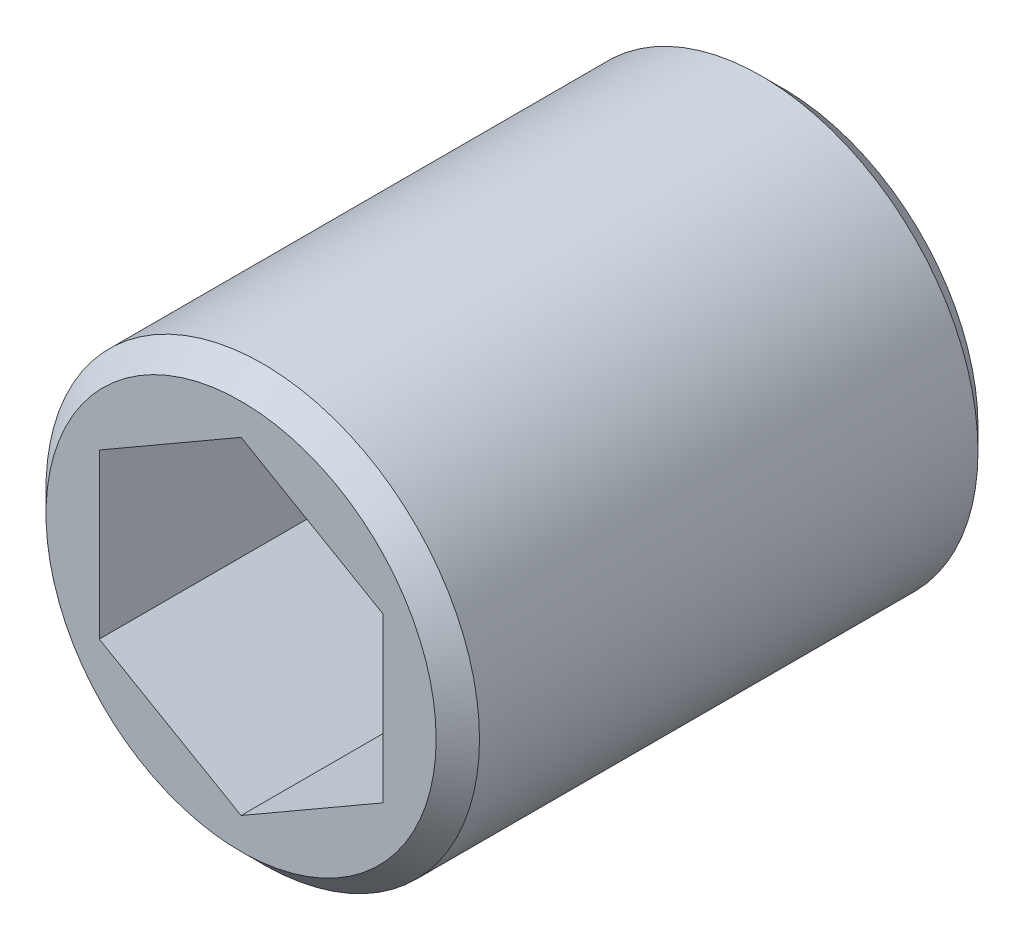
ISO-10303-21;
HEADER;
FILE_DESCRIPTION(('STEP AP214'),'2;1');
FILE_NAME('part.step','',(''),(''),'','','');
FILE_SCHEMA(('AUTOMOTIVE_DESIGN { 1 0 10303 214 1 1 1 1 }'));
ENDSEC;
DATA;
#1=APPLICATION_CONTEXT('core data for automotive mechanical design processes');
#2=APPLICATION_PROTOCOL_DEFINITION('international standard','automotive_design',2000,#1);
#3=PRODUCT_CONTEXT('',#1,'mechanical');
#4=PRODUCT('Part','Part','',(#3));
#5=PRODUCT_RELATED_PRODUCT_CATEGORY('part','',(#4));
#6=PRODUCT_DEFINITION_FORMATION('','',#4);
#7=PRODUCT_DEFINITION_CONTEXT('part definition',#1,'design');
#8=PRODUCT_DEFINITION('design','',#6,#7);
#9=PRODUCT_DEFINITION_SHAPE('','',#8);
#10=(LENGTH_UNIT() NAMED_UNIT(*) SI_UNIT(.MILLI.,.METRE.));
#11=(NAMED_UNIT(*) PLANE_ANGLE_UNIT() SI_UNIT($,.RADIAN.));
#12=(NAMED_UNIT(*) SI_UNIT($,.STERADIAN.) SOLID_ANGLE_UNIT());
#13=UNCERTAINTY_MEASURE_WITH_UNIT(LENGTH_MEASURE(1.E-05),#10,'distance_accuracy_value','');
#14=(GEOMETRIC_REPRESENTATION_CONTEXT(3) GLOBAL_UNCERTAINTY_ASSIGNED_CONTEXT((#13)) GLOBAL_UNIT_ASSIGNED_CONTEXT((#10,
#11,#12)) REPRESENTATION_CONTEXT('',''));
#15=CARTESIAN_POINT('',(0.,0.,0.));
#16=DIRECTION('',(0.,0.,1.));
#17=DIRECTION('',(1.,0.,0.));
#18=AXIS2_PLACEMENT_3D('',#15,#16,#17);
#19=CARTESIAN_POINT('',(0.,0.,3.175));
#20=DIRECTION('',(0.,0.,-1.));
#21=DIRECTION('',(-1.,0.,0.));
#22=AXIS2_PLACEMENT_3D('',#19,#20,#21);
#23=CYLINDRICAL_SURFACE('',#22,1.27);
#24=CARTESIAN_POINT('',(0.,0.,3.048));
#25=DIRECTION('',(0.,0.,1.));
#26=DIRECTION('',(1.,0.,0.));
#27=AXIS2_PLACEMENT_3D('',#24,#25,#26);
#28=CIRCLE('',#27,1.27);
#29=CARTESIAN_POINT('',(1.27,0.,3.048));
#30=VERTEX_POINT('',#29);
#31=EDGE_CURVE('E44',#30,#30,#28,.F.);
#32=ORIENTED_EDGE('',*,*,#31,.T.);
#33=EDGE_LOOP('',(#32));
#34=FACE_BOUND('',#33,.T.);
#35=CARTESIAN_POINT('',(0.,0.,0.127));
#36=DIRECTION('',(0.,0.,1.));
#37=DIRECTION('',(1.,0.,0.));
#38=AXIS2_PLACEMENT_3D('',#35,#36,#37);
#39=CIRCLE('',#38,1.27);
#40=CARTESIAN_POINT('',(1.27,0.,0.127));
#41=VERTEX_POINT('',#40);
#42=EDGE_CURVE('E146',#41,#41,#39,.T.);
#43=ORIENTED_EDGE('',*,*,#42,.T.);
#44=EDGE_LOOP('',(#43));
#45=FACE_BOUND('',#44,.T.);
#46=ADVANCED_FACE('F36',(#34,#45),#23,.T.);
#47=CARTESIAN_POINT('',(0.,0.,3.175));
#48=DIRECTION('',(0.,0.,1.));
#49=DIRECTION('',(1.,0.,0.));
#50=AXIS2_PLACEMENT_3D('',#47,#48,#49);
#51=PLANE('',#50);
#52=DIRECTION('',(-0.866025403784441,0.499999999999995,0.));
#53=VECTOR('',#52,1.);
#54=CARTESIAN_POINT('',(0.830967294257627,0.479759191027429,3.175));
#55=LINE('',#54,#53);
#56=CARTESIAN_POINT('',(0.830967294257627,0.479759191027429,3.175));
#57=VERTEX_POINT('',#56);
#58=CARTESIAN_POINT('',(0.,0.959518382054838,3.175));
#59=VERTEX_POINT('',#58);
#60=EDGE_CURVE('E51',#57,#59,#55,.T.);
#61=ORIENTED_EDGE('',*,*,#60,.F.);
#62=DIRECTION('',(0.,1.,0.));
#63=VECTOR('',#62,1.);
#64=CARTESIAN_POINT('',(0.830967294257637,-0.479759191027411,3.175));
#65=LINE('',#64,#63);
#66=CARTESIAN_POINT('',(0.830967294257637,-0.479759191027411,3.175));
#67=VERTEX_POINT('',#66);
#68=EDGE_CURVE('E134',#67,#57,#65,.T.);
#69=ORIENTED_EDGE('',*,*,#68,.F.);
#70=DIRECTION('',(0.866025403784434,0.500000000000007,0.));
#71=VECTOR('',#70,1.);
#72=CARTESIAN_POINT('',(0.,-0.959518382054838,3.175));
#73=LINE('',#72,#71);
#74=CARTESIAN_POINT('',(0.,-0.959518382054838,3.175));
#75=VERTEX_POINT('',#74);
#76=EDGE_CURVE('E132',#75,#67,#73,.T.);
#77=ORIENTED_EDGE('',*,*,#76,.F.);
#78=DIRECTION('',(0.866025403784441,-0.499999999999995,0.));
#79=VECTOR('',#78,1.);
#80=CARTESIAN_POINT('',(-0.83096729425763,-0.479759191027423,3.175));
#81=LINE('',#80,#79);
#82=CARTESIAN_POINT('',(-0.83096729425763,-0.479759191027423,3.175));
#83=VERTEX_POINT('',#82);
#84=EDGE_CURVE('E99',#83,#75,#81,.T.);
#85=ORIENTED_EDGE('',*,*,#84,.F.);
#86=DIRECTION('',(0.,-1.,0.));
#87=VECTOR('',#86,1.);
#88=CARTESIAN_POINT('',(-0.830967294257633,0.479759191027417,3.175));
#89=LINE('',#88,#87);
#90=CARTESIAN_POINT('',(-0.830967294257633,0.479759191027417,3.175));
#91=VERTEX_POINT('',#90);
#92=EDGE_CURVE('E128',#91,#83,#89,.T.);
#93=ORIENTED_EDGE('',*,*,#92,.F.);
#94=DIRECTION('',(-0.866025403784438,-0.500000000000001,0.));
#95=VECTOR('',#94,1.);
#96=CARTESIAN_POINT('',(0.,0.959518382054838,3.175));
#97=LINE('',#96,#95);
#98=EDGE_CURVE('E125',#59,#91,#97,.T.);
#99=ORIENTED_EDGE('',*,*,#98,.F.);
#100=EDGE_LOOP('',(#61,#69,#77,#85,#93,#99));
#101=FACE_BOUND('',#100,.T.);
#102=CARTESIAN_POINT('',(0.,0.,3.175));
#103=DIRECTION('',(0.,0.,1.));
#104=DIRECTION('',(1.,0.,0.));
#105=AXIS2_PLACEMENT_3D('',#102,#103,#104);
#106=CIRCLE('',#105,1.143);
#107=CARTESIAN_POINT('',(1.143,0.,3.175));
#108=VERTEX_POINT('',#107);
#109=EDGE_CURVE('E138',#108,#108,#106,.T.);
#110=ORIENTED_EDGE('',*,*,#109,.T.);
#111=EDGE_LOOP('',(#110));
#112=FACE_BOUND('',#111,.T.);
#113=ADVANCED_FACE('F159',(#101,#112),#51,.T.);
#114=CARTESIAN_POINT('',(0.,0.,0.));
#115=DIRECTION('',(0.,0.,1.));
#116=DIRECTION('',(1.,0.,0.));
#117=AXIS2_PLACEMENT_3D('',#114,#115,#116);
#118=PLANE('',#117);
#119=CARTESIAN_POINT('',(0.,0.,0.));
#120=DIRECTION('',(0.,0.,1.));
#121=DIRECTION('',(1.,0.,0.));
#122=AXIS2_PLACEMENT_3D('',#119,#120,#121);
#123=CIRCLE('',#122,1.143);
#124=CARTESIAN_POINT('',(1.143,0.,0.));
#125=VERTEX_POINT('',#124);
#126=EDGE_CURVE('E11',#125,#125,#123,.F.);
#127=ORIENTED_EDGE('',*,*,#126,.T.);
#128=EDGE_LOOP('',(#127));
#129=FACE_BOUND('',#128,.T.);
#130=ADVANCED_FACE('F156',(#129),#118,.F.);
#131=CARTESIAN_POINT('',(0.,0.,3.175));
#132=DIRECTION('',(0.,0.,-1.));
#133=DIRECTION('',(-1.,0.,0.));
#134=AXIS2_PLACEMENT_3D('',#131,#132,#133);
#135=CONICAL_SURFACE('',#134,1.143,0.785398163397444);
#136=ORIENTED_EDGE('',*,*,#31,.F.);
#137=EDGE_LOOP('',(#136));
#138=FACE_BOUND('',#137,.T.);
#139=ORIENTED_EDGE('',*,*,#109,.F.);
#140=EDGE_LOOP('',(#139));
#141=FACE_BOUND('',#140,.T.);
#142=ADVANCED_FACE('F153',(#138,#141),#135,.T.);
#143=CARTESIAN_POINT('',(0.,0.,0.127));
#144=DIRECTION('',(0.,0.,1.));
#145=DIRECTION('',(1.,0.,0.));
#146=AXIS2_PLACEMENT_3D('',#143,#144,#145);
#147=CONICAL_SURFACE('',#146,1.27,0.785398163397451);
#148=ORIENTED_EDGE('',*,*,#126,.F.);
#149=EDGE_LOOP('',(#148));
#150=FACE_BOUND('',#149,.T.);
#151=ORIENTED_EDGE('',*,*,#42,.F.);
#152=EDGE_LOOP('',(#151));
#153=FACE_BOUND('',#152,.T.);
#154=ADVANCED_FACE('F38',(#150,#153),#147,.T.);
#155=CARTESIAN_POINT('',(0.830967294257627,0.479759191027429,1.5875));
#156=DIRECTION('',(0.499999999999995,0.866025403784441,0.));
#157=DIRECTION('',(-0.866025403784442,0.499999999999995,0.));
#158=AXIS2_PLACEMENT_3D('',#155,#156,#157);
#159=PLANE('',#158);
#160=ORIENTED_EDGE('',*,*,#60,.T.);
#161=DIRECTION('',(0.,0.,1.));
#162=VECTOR('',#161,1.);
#163=CARTESIAN_POINT('',(0.,0.959518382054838,1.5875));
#164=LINE('',#163,#162);
#165=CARTESIAN_POINT('',(0.,0.959518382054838,1.5875));
#166=VERTEX_POINT('',#165);
#167=EDGE_CURVE('E81',#166,#59,#164,.T.);
#168=ORIENTED_EDGE('',*,*,#167,.F.);
#169=DIRECTION('',(-0.866025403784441,0.499999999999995,0.));
#170=VECTOR('',#169,1.);
#171=CARTESIAN_POINT('',(0.830967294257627,0.479759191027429,1.5875));
#172=LINE('',#171,#170);
#173=CARTESIAN_POINT('',(0.830967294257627,0.479759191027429,1.5875));
#174=VERTEX_POINT('',#173);
#175=EDGE_CURVE('E136',#174,#166,#172,.T.);
#176=ORIENTED_EDGE('',*,*,#175,.F.);
#177=DIRECTION('',(0.,0.,1.));
#178=VECTOR('',#177,1.);
#179=CARTESIAN_POINT('',(0.830967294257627,0.479759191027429,1.5875));
#180=LINE('',#179,#178);
#181=EDGE_CURVE('E59',#174,#57,#180,.T.);
#182=ORIENTED_EDGE('',*,*,#181,.T.);
#183=EDGE_LOOP('',(#160,#168,#176,#182));
#184=FACE_BOUND('',#183,.T.);
#185=ADVANCED_FACE('F171',(#184),#159,.F.);
#186=CARTESIAN_POINT('',(0.830967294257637,-0.479759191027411,1.5875));
#187=DIRECTION('',(1.,0.,0.));
#188=DIRECTION('',(0.,1.,0.));
#189=AXIS2_PLACEMENT_3D('',#186,#187,#188);
#190=PLANE('',#189);
#191=ORIENTED_EDGE('',*,*,#68,.T.);
#192=ORIENTED_EDGE('',*,*,#181,.F.);
#193=DIRECTION('',(0.,1.,0.));
#194=VECTOR('',#193,1.);
#195=CARTESIAN_POINT('',(0.830967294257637,-0.479759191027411,1.5875));
#196=LINE('',#195,#194);
#197=CARTESIAN_POINT('',(0.830967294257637,-0.479759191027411,1.5875));
#198=VERTEX_POINT('',#197);
#199=EDGE_CURVE('E111',#198,#174,#196,.T.);
#200=ORIENTED_EDGE('',*,*,#199,.F.);
#201=DIRECTION('',(0.,0.,1.));
#202=VECTOR('',#201,1.);
#203=CARTESIAN_POINT('',(0.830967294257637,-0.479759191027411,1.5875));
#204=LINE('',#203,#202);
#205=EDGE_CURVE('E103',#198,#67,#204,.T.);
#206=ORIENTED_EDGE('',*,*,#205,.T.);
#207=EDGE_LOOP('',(#191,#192,#200,#206));
#208=FACE_BOUND('',#207,.T.);
#209=ADVANCED_FACE('F174',(#208),#190,.F.);
#210=CARTESIAN_POINT('',(0.,-0.959518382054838,1.5875));
#211=DIRECTION('',(0.500000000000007,-0.866025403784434,0.));
#212=DIRECTION('',(0.866025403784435,0.500000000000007,0.));
#213=AXIS2_PLACEMENT_3D('',#210,#211,#212);
#214=PLANE('',#213);
#215=ORIENTED_EDGE('',*,*,#76,.T.);
#216=ORIENTED_EDGE('',*,*,#205,.F.);
#217=DIRECTION('',(0.866025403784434,0.500000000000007,0.));
#218=VECTOR('',#217,1.);
#219=CARTESIAN_POINT('',(0.,-0.959518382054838,1.5875));
#220=LINE('',#219,#218);
#221=CARTESIAN_POINT('',(0.,-0.959518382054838,1.5875));
#222=VERTEX_POINT('',#221);
#223=EDGE_CURVE('E107',#222,#198,#220,.T.);
#224=ORIENTED_EDGE('',*,*,#223,.F.);
#225=DIRECTION('',(0.,0.,1.));
#226=VECTOR('',#225,1.);
#227=CARTESIAN_POINT('',(0.,-0.959518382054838,1.5875));
#228=LINE('',#227,#226);
#229=EDGE_CURVE('E92',#222,#75,#228,.T.);
#230=ORIENTED_EDGE('',*,*,#229,.T.);
#231=EDGE_LOOP('',(#215,#216,#224,#230));
#232=FACE_BOUND('',#231,.T.);
#233=ADVANCED_FACE('F108',(#232),#214,.F.);
#234=CARTESIAN_POINT('',(-0.83096729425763,-0.479759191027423,1.5875));
#235=DIRECTION('',(-0.499999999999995,-0.866025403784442,0.));
#236=DIRECTION('',(0.866025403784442,-0.499999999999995,0.));
#237=AXIS2_PLACEMENT_3D('',#234,#235,#236);
#238=PLANE('',#237);
#239=ORIENTED_EDGE('',*,*,#84,.T.);
#240=ORIENTED_EDGE('',*,*,#229,.F.);
#241=DIRECTION('',(0.866025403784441,-0.499999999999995,0.));
#242=VECTOR('',#241,1.);
#243=CARTESIAN_POINT('',(-0.83096729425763,-0.479759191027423,1.5875));
#244=LINE('',#243,#242);
#245=CARTESIAN_POINT('',(-0.83096729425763,-0.479759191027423,1.5875));
#246=VERTEX_POINT('',#245);
#247=EDGE_CURVE('E96',#246,#222,#244,.T.);
#248=ORIENTED_EDGE('',*,*,#247,.F.);
#249=DIRECTION('',(0.,0.,1.));
#250=VECTOR('',#249,1.);
#251=CARTESIAN_POINT('',(-0.83096729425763,-0.479759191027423,1.5875));
#252=LINE('',#251,#250);
#253=EDGE_CURVE('E104',#246,#83,#252,.T.);
#254=ORIENTED_EDGE('',*,*,#253,.T.);
#255=EDGE_LOOP('',(#239,#240,#248,#254));
#256=FACE_BOUND('',#255,.T.);
#257=ADVANCED_FACE('F94',(#256),#238,.F.);
#258=CARTESIAN_POINT('',(-0.830967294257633,0.479759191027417,1.5875));
#259=DIRECTION('',(-1.,0.,0.));
#260=DIRECTION('',(0.,-1.,0.));
#261=AXIS2_PLACEMENT_3D('',#258,#259,#260);
#262=PLANE('',#261);
#263=ORIENTED_EDGE('',*,*,#92,.T.);
#264=ORIENTED_EDGE('',*,*,#253,.F.);
#265=DIRECTION('',(0.,-1.,0.));
#266=VECTOR('',#265,1.);
#267=CARTESIAN_POINT('',(-0.830967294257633,0.479759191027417,1.5875));
#268=LINE('',#267,#266);
#269=CARTESIAN_POINT('',(-0.830967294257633,0.479759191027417,1.5875));
#270=VERTEX_POINT('',#269);
#271=EDGE_CURVE('E117',#270,#246,#268,.T.);
#272=ORIENTED_EDGE('',*,*,#271,.F.);
#273=DIRECTION('',(0.,0.,1.));
#274=VECTOR('',#273,1.);
#275=CARTESIAN_POINT('',(-0.830967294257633,0.479759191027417,1.5875));
#276=LINE('',#275,#274);
#277=EDGE_CURVE('E141',#270,#91,#276,.T.);
#278=ORIENTED_EDGE('',*,*,#277,.T.);
#279=EDGE_LOOP('',(#263,#264,#272,#278));
#280=FACE_BOUND('',#279,.T.);
#281=ADVANCED_FACE('F178',(#280),#262,.F.);
#282=CARTESIAN_POINT('',(0.,0.959518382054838,1.5875));
#283=DIRECTION('',(-0.500000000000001,0.866025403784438,0.));
#284=DIRECTION('',(-0.866025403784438,-0.500000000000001,0.));
#285=AXIS2_PLACEMENT_3D('',#282,#283,#284);
#286=PLANE('',#285);
#287=ORIENTED_EDGE('',*,*,#98,.T.);
#288=ORIENTED_EDGE('',*,*,#277,.F.);
#289=DIRECTION('',(-0.866025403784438,-0.500000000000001,0.));
#290=VECTOR('',#289,1.);
#291=CARTESIAN_POINT('',(0.,0.959518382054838,1.5875));
#292=LINE('',#291,#290);
#293=EDGE_CURVE('E119',#166,#270,#292,.T.);
#294=ORIENTED_EDGE('',*,*,#293,.F.);
#295=ORIENTED_EDGE('',*,*,#167,.T.);
#296=EDGE_LOOP('',(#287,#288,#294,#295));
#297=FACE_BOUND('',#296,.T.);
#298=ADVANCED_FACE('F175',(#297),#286,.F.);
#299=CARTESIAN_POINT('',(0.,0.959518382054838,1.5875));
#300=DIRECTION('',(0.,0.,1.));
#301=DIRECTION('',(1.,0.,0.));
#302=AXIS2_PLACEMENT_3D('',#299,#300,#301);
#303=PLANE('',#302);
#304=ORIENTED_EDGE('',*,*,#175,.T.);
#305=ORIENTED_EDGE('',*,*,#293,.T.);
#306=ORIENTED_EDGE('',*,*,#271,.T.);
#307=ORIENTED_EDGE('',*,*,#247,.T.);
#308=ORIENTED_EDGE('',*,*,#223,.T.);
#309=ORIENTED_EDGE('',*,*,#199,.T.);
#310=EDGE_LOOP('',(#304,#305,#306,#307,#308,#309));
#311=FACE_BOUND('',#310,.T.);
#312=ADVANCED_FACE('F114',(#311),#303,.T.);
#313=CLOSED_SHELL('',(#46,#113,#130,#142,#154,#185,#209,#233,#257,#281,#298,#312));
#314=MANIFOLD_SOLID_BREP('B2',#313);
#315=ADVANCED_BREP_SHAPE_REPRESENTATION('',(#18,#314),#14);
#316=SHAPE_DEFINITION_REPRESENTATION(#9,#315);
ENDSEC;
END-ISO-10303-21;
